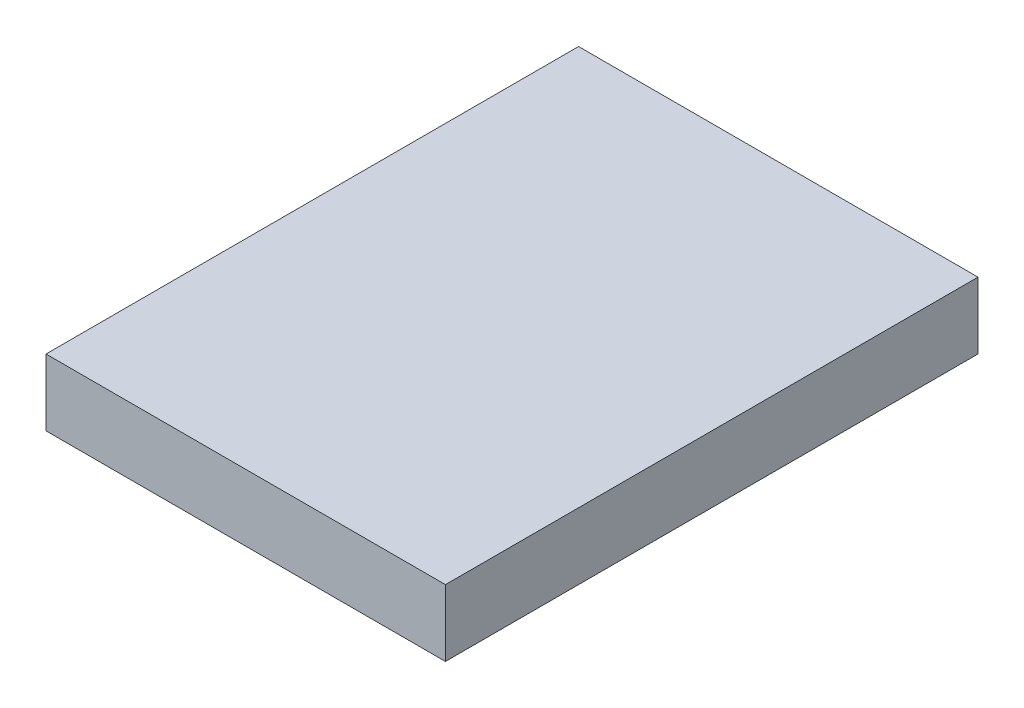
ISO-10303-21;
HEADER;
FILE_DESCRIPTION(('STEP AP214'),'2;1');
FILE_NAME('part.step','',(''),(''),'','','');
FILE_SCHEMA(('AUTOMOTIVE_DESIGN { 1 0 10303 214 1 1 1 1 }'));
ENDSEC;
DATA;
#1=APPLICATION_CONTEXT('core data for automotive mechanical design processes');
#2=APPLICATION_PROTOCOL_DEFINITION('international standard','automotive_design',2000,#1);
#3=PRODUCT_CONTEXT('',#1,'mechanical');
#4=PRODUCT('Part','Part','',(#3));
#5=PRODUCT_RELATED_PRODUCT_CATEGORY('part','',(#4));
#6=PRODUCT_DEFINITION_FORMATION('','',#4);
#7=PRODUCT_DEFINITION_CONTEXT('part definition',#1,'design');
#8=PRODUCT_DEFINITION('design','',#6,#7);
#9=PRODUCT_DEFINITION_SHAPE('','',#8);
#10=(LENGTH_UNIT() NAMED_UNIT(*) SI_UNIT(.MILLI.,.METRE.));
#11=(NAMED_UNIT(*) PLANE_ANGLE_UNIT() SI_UNIT($,.RADIAN.));
#12=(NAMED_UNIT(*) SI_UNIT($,.STERADIAN.) SOLID_ANGLE_UNIT());
#13=UNCERTAINTY_MEASURE_WITH_UNIT(LENGTH_MEASURE(1.E-05),#10,'distance_accuracy_value','');
#14=(GEOMETRIC_REPRESENTATION_CONTEXT(3) GLOBAL_UNCERTAINTY_ASSIGNED_CONTEXT((#13)) GLOBAL_UNIT_ASSIGNED_CONTEXT((#10,
#11,#12)) REPRESENTATION_CONTEXT('',''));
#15=CARTESIAN_POINT('',(0.,0.,0.));
#16=DIRECTION('',(0.,0.,1.));
#17=DIRECTION('',(1.,0.,0.));
#18=AXIS2_PLACEMENT_3D('',#15,#16,#17);
#19=CARTESIAN_POINT('',(-15.,2.5,20.));
#20=DIRECTION('',(1.,0.,0.));
#21=DIRECTION('',(0.,0.,-1.));
#22=AXIS2_PLACEMENT_3D('',#19,#20,#21);
#23=PLANE('',#22);
#24=DIRECTION('',(0.,-1.,0.));
#25=VECTOR('',#24,1.);
#26=CARTESIAN_POINT('',(-15.,2.50000000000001,-20.));
#27=LINE('',#26,#25);
#28=CARTESIAN_POINT('',(-15.,2.50000000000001,-20.));
#29=VERTEX_POINT('',#28);
#30=CARTESIAN_POINT('',(-15.,-2.5,-20.));
#31=VERTEX_POINT('',#30);
#32=EDGE_CURVE('E81',#29,#31,#27,.T.);
#33=ORIENTED_EDGE('',*,*,#32,.T.);
#34=DIRECTION('',(0.,0.,-1.));
#35=VECTOR('',#34,1.);
#36=CARTESIAN_POINT('',(-15.,-2.50000000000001,20.));
#37=LINE('',#36,#35);
#38=CARTESIAN_POINT('',(-15.,-2.50000000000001,20.));
#39=VERTEX_POINT('',#38);
#40=EDGE_CURVE('E11',#39,#31,#37,.T.);
#41=ORIENTED_EDGE('',*,*,#40,.F.);
#42=DIRECTION('',(0.,-1.,0.));
#43=VECTOR('',#42,1.);
#44=CARTESIAN_POINT('',(-15.,2.5,20.));
#45=LINE('',#44,#43);
#46=CARTESIAN_POINT('',(-15.,2.5,20.));
#47=VERTEX_POINT('',#46);
#48=EDGE_CURVE('E104',#47,#39,#45,.T.);
#49=ORIENTED_EDGE('',*,*,#48,.F.);
#50=DIRECTION('',(0.,0.,-1.));
#51=VECTOR('',#50,1.);
#52=CARTESIAN_POINT('',(-15.,2.5,20.));
#53=LINE('',#52,#51);
#54=EDGE_CURVE('E94',#47,#29,#53,.T.);
#55=ORIENTED_EDGE('',*,*,#54,.T.);
#56=EDGE_LOOP('',(#33,#41,#49,#55));
#57=FACE_BOUND('',#56,.T.);
#58=ADVANCED_FACE('F36',(#57),#23,.F.);
#59=CARTESIAN_POINT('',(-15.,-2.50000000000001,20.));
#60=DIRECTION('',(0.,1.,0.));
#61=DIRECTION('',(-1.,0.,0.));
#62=AXIS2_PLACEMENT_3D('',#59,#60,#61);
#63=PLANE('',#62);
#64=DIRECTION('',(1.,0.,0.));
#65=VECTOR('',#64,1.);
#66=CARTESIAN_POINT('',(-15.,-2.5,-20.));
#67=LINE('',#66,#65);
#68=CARTESIAN_POINT('',(15.,-2.5,-20.));
#69=VERTEX_POINT('',#68);
#70=EDGE_CURVE('E77',#31,#69,#67,.T.);
#71=ORIENTED_EDGE('',*,*,#70,.T.);
#72=DIRECTION('',(0.,0.,-1.));
#73=VECTOR('',#72,1.);
#74=CARTESIAN_POINT('',(15.,-2.5,20.));
#75=LINE('',#74,#73);
#76=CARTESIAN_POINT('',(15.,-2.5,20.));
#77=VERTEX_POINT('',#76);
#78=EDGE_CURVE('E44',#77,#69,#75,.T.);
#79=ORIENTED_EDGE('',*,*,#78,.F.);
#80=DIRECTION('',(1.,0.,0.));
#81=VECTOR('',#80,1.);
#82=CARTESIAN_POINT('',(-15.,-2.50000000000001,20.));
#83=LINE('',#82,#81);
#84=EDGE_CURVE('E90',#39,#77,#83,.T.);
#85=ORIENTED_EDGE('',*,*,#84,.F.);
#86=ORIENTED_EDGE('',*,*,#40,.T.);
#87=EDGE_LOOP('',(#71,#79,#85,#86));
#88=FACE_BOUND('',#87,.T.);
#89=ADVANCED_FACE('F89',(#88),#63,.F.);
#90=CARTESIAN_POINT('',(15.,2.5,20.));
#91=DIRECTION('',(-1.,0.,0.));
#92=DIRECTION('',(0.,0.,1.));
#93=AXIS2_PLACEMENT_3D('',#90,#91,#92);
#94=PLANE('',#93);
#95=DIRECTION('',(0.,1.,0.));
#96=VECTOR('',#95,1.);
#97=CARTESIAN_POINT('',(15.,2.5,-20.));
#98=LINE('',#97,#96);
#99=CARTESIAN_POINT('',(15.,2.5,-20.));
#100=VERTEX_POINT('',#99);
#101=EDGE_CURVE('E82',#69,#100,#98,.T.);
#102=ORIENTED_EDGE('',*,*,#101,.T.);
#103=DIRECTION('',(0.,0.,-1.));
#104=VECTOR('',#103,1.);
#105=CARTESIAN_POINT('',(15.,2.5,20.));
#106=LINE('',#105,#104);
#107=CARTESIAN_POINT('',(15.,2.5,20.));
#108=VERTEX_POINT('',#107);
#109=EDGE_CURVE('E114',#108,#100,#106,.T.);
#110=ORIENTED_EDGE('',*,*,#109,.F.);
#111=DIRECTION('',(0.,1.,0.));
#112=VECTOR('',#111,1.);
#113=CARTESIAN_POINT('',(15.,2.5,20.));
#114=LINE('',#113,#112);
#115=EDGE_CURVE('E56',#77,#108,#114,.T.);
#116=ORIENTED_EDGE('',*,*,#115,.F.);
#117=ORIENTED_EDGE('',*,*,#78,.T.);
#118=EDGE_LOOP('',(#102,#110,#116,#117));
#119=FACE_BOUND('',#118,.T.);
#120=ADVANCED_FACE('F119',(#119),#94,.F.);
#121=CARTESIAN_POINT('',(-15.,2.5,20.));
#122=DIRECTION('',(0.,-1.,0.));
#123=DIRECTION('',(1.,0.,0.));
#124=AXIS2_PLACEMENT_3D('',#121,#122,#123);
#125=PLANE('',#124);
#126=DIRECTION('',(-1.,0.,0.));
#127=VECTOR('',#126,1.);
#128=CARTESIAN_POINT('',(-15.,2.50000000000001,-20.));
#129=LINE('',#128,#127);
#130=EDGE_CURVE('E101',#100,#29,#129,.T.);
#131=ORIENTED_EDGE('',*,*,#130,.T.);
#132=ORIENTED_EDGE('',*,*,#54,.F.);
#133=DIRECTION('',(-1.,0.,0.));
#134=VECTOR('',#133,1.);
#135=CARTESIAN_POINT('',(-15.,2.5,20.));
#136=LINE('',#135,#134);
#137=EDGE_CURVE('E51',#108,#47,#136,.T.);
#138=ORIENTED_EDGE('',*,*,#137,.F.);
#139=ORIENTED_EDGE('',*,*,#109,.T.);
#140=EDGE_LOOP('',(#131,#132,#138,#139));
#141=FACE_BOUND('',#140,.T.);
#142=ADVANCED_FACE('F121',(#141),#125,.F.);
#143=CARTESIAN_POINT('',(-15.,-2.50000000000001,20.));
#144=DIRECTION('',(0.,0.,1.));
#145=DIRECTION('',(1.,0.,0.));
#146=AXIS2_PLACEMENT_3D('',#143,#144,#145);
#147=PLANE('',#146);
#148=ORIENTED_EDGE('',*,*,#48,.T.);
#149=ORIENTED_EDGE('',*,*,#84,.T.);
#150=ORIENTED_EDGE('',*,*,#115,.T.);
#151=ORIENTED_EDGE('',*,*,#137,.T.);
#152=EDGE_LOOP('',(#148,#149,#150,#151));
#153=FACE_BOUND('',#152,.T.);
#154=ADVANCED_FACE('F122',(#153),#147,.T.);
#155=CARTESIAN_POINT('',(-15.,-2.5,-20.));
#156=DIRECTION('',(0.,0.,1.));
#157=DIRECTION('',(1.,0.,0.));
#158=AXIS2_PLACEMENT_3D('',#155,#156,#157);
#159=PLANE('',#158);
#160=ORIENTED_EDGE('',*,*,#32,.F.);
#161=ORIENTED_EDGE('',*,*,#130,.F.);
#162=ORIENTED_EDGE('',*,*,#101,.F.);
#163=ORIENTED_EDGE('',*,*,#70,.F.);
#164=EDGE_LOOP('',(#160,#161,#162,#163));
#165=FACE_BOUND('',#164,.T.);
#166=ADVANCED_FACE('F78',(#165),#159,.F.);
#167=CLOSED_SHELL('',(#58,#89,#120,#142,#154,#166));
#168=MANIFOLD_SOLID_BREP('B2',#167);
#169=ADVANCED_BREP_SHAPE_REPRESENTATION('',(#18,#168),#14);
#170=SHAPE_DEFINITION_REPRESENTATION(#9,#169);
ENDSEC;
END-ISO-10303-21;
